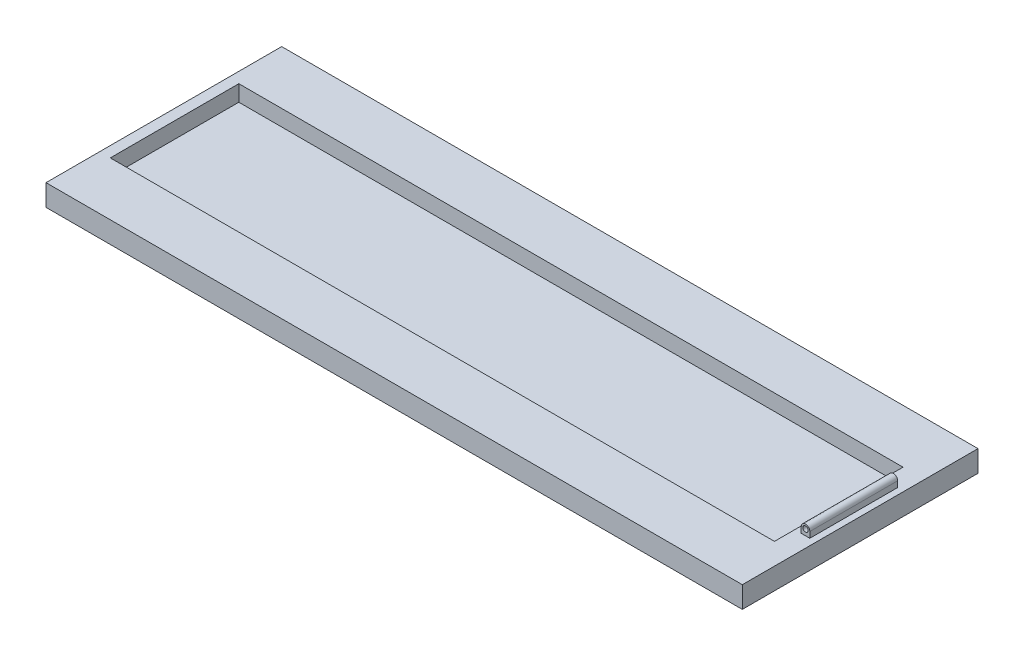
ISO-10303-21;
HEADER;
FILE_DESCRIPTION(('STEP AP214'),'2;1');
FILE_NAME('part.step','',(''),(''),'','','');
FILE_SCHEMA(('AUTOMOTIVE_DESIGN { 1 0 10303 214 1 1 1 1 }'));
ENDSEC;
DATA;
#1=APPLICATION_CONTEXT('core data for automotive mechanical design processes');
#2=APPLICATION_PROTOCOL_DEFINITION('international standard','automotive_design',2000,#1);
#3=PRODUCT_CONTEXT('',#1,'mechanical');
#4=PRODUCT('Part','Part','',(#3));
#5=PRODUCT_RELATED_PRODUCT_CATEGORY('part','',(#4));
#6=PRODUCT_DEFINITION_FORMATION('','',#4);
#7=PRODUCT_DEFINITION_CONTEXT('part definition',#1,'design');
#8=PRODUCT_DEFINITION('design','',#6,#7);
#9=PRODUCT_DEFINITION_SHAPE('','',#8);
#10=(LENGTH_UNIT() NAMED_UNIT(*) SI_UNIT(.MILLI.,.METRE.));
#11=(NAMED_UNIT(*) PLANE_ANGLE_UNIT() SI_UNIT($,.RADIAN.));
#12=(NAMED_UNIT(*) SI_UNIT($,.STERADIAN.) SOLID_ANGLE_UNIT());
#13=UNCERTAINTY_MEASURE_WITH_UNIT(LENGTH_MEASURE(1.E-05),#10,'distance_accuracy_value','');
#14=(GEOMETRIC_REPRESENTATION_CONTEXT(3) GLOBAL_UNCERTAINTY_ASSIGNED_CONTEXT((#13)) GLOBAL_UNIT_ASSIGNED_CONTEXT((#10,
#11,#12)) REPRESENTATION_CONTEXT('',''));
#15=CARTESIAN_POINT('',(0.,0.,0.));
#16=DIRECTION('',(0.,0.,1.));
#17=DIRECTION('',(1.,0.,0.));
#18=AXIS2_PLACEMENT_3D('',#15,#16,#17);
#19=CARTESIAN_POINT('',(-6400.,-55.,1100.));
#20=DIRECTION('',(0.,-1.,0.));
#21=DIRECTION('',(0.,0.,-1.));
#22=AXIS2_PLACEMENT_3D('',#19,#20,#21);
#23=PLANE('',#22);
#24=DIRECTION('',(1.,0.,0.));
#25=VECTOR('',#24,1.);
#26=CARTESIAN_POINT('',(-6300.,-55.,600.));
#27=LINE('',#26,#25);
#28=CARTESIAN_POINT('',(-6300.,-55.,600.));
#29=VERTEX_POINT('',#28);
#30=CARTESIAN_POINT('',(-99.9999999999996,-55.,600.));
#31=VERTEX_POINT('',#30);
#32=EDGE_CURVE('E151',#29,#31,#27,.T.);
#33=ORIENTED_EDGE('',*,*,#32,.F.);
#34=DIRECTION('',(0.,0.,1.));
#35=VECTOR('',#34,1.);
#36=CARTESIAN_POINT('',(-6300.,-55.,-600.));
#37=LINE('',#36,#35);
#38=CARTESIAN_POINT('',(-6300.,-55.,-600.));
#39=VERTEX_POINT('',#38);
#40=EDGE_CURVE('E48',#39,#29,#37,.T.);
#41=ORIENTED_EDGE('',*,*,#40,.F.);
#42=DIRECTION('',(-1.,0.,0.));
#43=VECTOR('',#42,1.);
#44=CARTESIAN_POINT('',(-6300.,-55.,-600.));
#45=LINE('',#44,#43);
#46=CARTESIAN_POINT('',(-99.9999999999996,-55.,-600.));
#47=VERTEX_POINT('',#46);
#48=EDGE_CURVE('E142',#47,#39,#45,.T.);
#49=ORIENTED_EDGE('',*,*,#48,.F.);
#50=DIRECTION('',(0.,0.,-1.));
#51=VECTOR('',#50,1.);
#52=CARTESIAN_POINT('',(-99.9999999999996,-55.,-600.));
#53=LINE('',#52,#51);
#54=EDGE_CURVE('E145',#31,#47,#53,.T.);
#55=ORIENTED_EDGE('',*,*,#54,.F.);
#56=EDGE_LOOP('',(#33,#41,#49,#55));
#57=FACE_BOUND('',#56,.T.);
#58=DIRECTION('',(-1.,0.,0.));
#59=VECTOR('',#58,1.);
#60=CARTESIAN_POINT('',(-6400.,-55.,-1100.));
#61=LINE('',#60,#59);
#62=CARTESIAN_POINT('',(100.,-55.,-1100.));
#63=VERTEX_POINT('',#62);
#64=CARTESIAN_POINT('',(-6400.,-55.,-1100.));
#65=VERTEX_POINT('',#64);
#66=EDGE_CURVE('E200',#63,#65,#61,.T.);
#67=ORIENTED_EDGE('',*,*,#66,.T.);
#68=DIRECTION('',(0.,0.,-1.));
#69=VECTOR('',#68,1.);
#70=CARTESIAN_POINT('',(-6400.,-55.,1100.));
#71=LINE('',#70,#69);
#72=CARTESIAN_POINT('',(-6400.,-55.,1100.));
#73=VERTEX_POINT('',#72);
#74=EDGE_CURVE('E206',#73,#65,#71,.T.);
#75=ORIENTED_EDGE('',*,*,#74,.F.);
#76=DIRECTION('',(-1.,0.,0.));
#77=VECTOR('',#76,1.);
#78=CARTESIAN_POINT('',(-6400.,-55.,1100.));
#79=LINE('',#78,#77);
#80=CARTESIAN_POINT('',(100.,-55.,1100.));
#81=VERTEX_POINT('',#80);
#82=EDGE_CURVE('E204',#81,#73,#79,.T.);
#83=ORIENTED_EDGE('',*,*,#82,.F.);
#84=DIRECTION('',(0.,0.,-1.));
#85=VECTOR('',#84,1.);
#86=CARTESIAN_POINT('',(100.,-55.,1100.));
#87=LINE('',#86,#85);
#88=EDGE_CURVE('E216',#81,#63,#87,.T.);
#89=ORIENTED_EDGE('',*,*,#88,.T.);
#90=EDGE_LOOP('',(#67,#75,#83,#89));
#91=FACE_BOUND('',#90,.T.);
#92=DIRECTION('',(0.,0.,-1.));
#93=VECTOR('',#92,1.);
#94=CARTESIAN_POINT('',(-40.,-55.,410.));
#95=LINE('',#94,#93);
#96=CARTESIAN_POINT('',(-40.,-55.,410.));
#97=VERTEX_POINT('',#96);
#98=CARTESIAN_POINT('',(-40.,-55.,-410.));
#99=VERTEX_POINT('',#98);
#100=EDGE_CURVE('E190',#97,#99,#95,.T.);
#101=ORIENTED_EDGE('',*,*,#100,.T.);
#102=DIRECTION('',(1.,0.,0.));
#103=VECTOR('',#102,1.);
#104=CARTESIAN_POINT('',(-40.,-55.,-410.));
#105=LINE('',#104,#103);
#106=CARTESIAN_POINT('',(40.,-55.,-410.));
#107=VERTEX_POINT('',#106);
#108=EDGE_CURVE('E182',#99,#107,#105,.T.);
#109=ORIENTED_EDGE('',*,*,#108,.T.);
#110=DIRECTION('',(0.,0.,-1.));
#111=VECTOR('',#110,1.);
#112=CARTESIAN_POINT('',(40.,-55.,410.));
#113=LINE('',#112,#111);
#114=CARTESIAN_POINT('',(40.,-55.,410.));
#115=VERTEX_POINT('',#114);
#116=EDGE_CURVE('E187',#115,#107,#113,.T.);
#117=ORIENTED_EDGE('',*,*,#116,.F.);
#118=DIRECTION('',(1.,0.,0.));
#119=VECTOR('',#118,1.);
#120=CARTESIAN_POINT('',(-40.,-55.,410.));
#121=LINE('',#120,#119);
#122=EDGE_CURVE('E56',#97,#115,#121,.T.);
#123=ORIENTED_EDGE('',*,*,#122,.F.);
#124=EDGE_LOOP('',(#101,#109,#117,#123));
#125=FACE_BOUND('',#124,.T.);
#126=ADVANCED_FACE('F33',(#57,#91,#125),#23,.F.);
#127=CARTESIAN_POINT('',(-6400.,-55.,1100.));
#128=DIRECTION('',(1.,0.,0.));
#129=DIRECTION('',(0.,0.,-1.));
#130=AXIS2_PLACEMENT_3D('',#127,#128,#129);
#131=PLANE('',#130);
#132=DIRECTION('',(0.,-1.,0.));
#133=VECTOR('',#132,1.);
#134=CARTESIAN_POINT('',(-6400.,-55.,-1100.));
#135=LINE('',#134,#133);
#136=CARTESIAN_POINT('',(-6400.,-255.,-1100.));
#137=VERTEX_POINT('',#136);
#138=EDGE_CURVE('E195',#65,#137,#135,.T.);
#139=ORIENTED_EDGE('',*,*,#138,.T.);
#140=DIRECTION('',(0.,0.,-1.));
#141=VECTOR('',#140,1.);
#142=CARTESIAN_POINT('',(-6400.,-255.,1100.));
#143=LINE('',#142,#141);
#144=CARTESIAN_POINT('',(-6400.,-255.,1100.));
#145=VERTEX_POINT('',#144);
#146=EDGE_CURVE('E11',#145,#137,#143,.T.);
#147=ORIENTED_EDGE('',*,*,#146,.F.);
#148=DIRECTION('',(0.,-1.,0.));
#149=VECTOR('',#148,1.);
#150=CARTESIAN_POINT('',(-6400.,-55.,1100.));
#151=LINE('',#150,#149);
#152=EDGE_CURVE('E196',#73,#145,#151,.T.);
#153=ORIENTED_EDGE('',*,*,#152,.F.);
#154=ORIENTED_EDGE('',*,*,#74,.T.);
#155=EDGE_LOOP('',(#139,#147,#153,#154));
#156=FACE_BOUND('',#155,.T.);
#157=ADVANCED_FACE('F35',(#156),#131,.F.);
#158=CARTESIAN_POINT('',(-6400.,-255.,1100.));
#159=DIRECTION('',(0.,1.,0.));
#160=DIRECTION('',(0.,0.,1.));
#161=AXIS2_PLACEMENT_3D('',#158,#159,#160);
#162=PLANE('',#161);
#163=DIRECTION('',(1.,0.,0.));
#164=VECTOR('',#163,1.);
#165=CARTESIAN_POINT('',(-6400.,-255.,-1100.));
#166=LINE('',#165,#164);
#167=CARTESIAN_POINT('',(100.,-255.,-1100.));
#168=VERTEX_POINT('',#167);
#169=EDGE_CURVE('E209',#137,#168,#166,.T.);
#170=ORIENTED_EDGE('',*,*,#169,.T.);
#171=DIRECTION('',(0.,0.,-1.));
#172=VECTOR('',#171,1.);
#173=CARTESIAN_POINT('',(100.,-255.,1100.));
#174=LINE('',#173,#172);
#175=CARTESIAN_POINT('',(100.,-255.,1100.));
#176=VERTEX_POINT('',#175);
#177=EDGE_CURVE('E41',#176,#168,#174,.T.);
#178=ORIENTED_EDGE('',*,*,#177,.F.);
#179=DIRECTION('',(1.,0.,0.));
#180=VECTOR('',#179,1.);
#181=CARTESIAN_POINT('',(-6400.,-255.,1100.));
#182=LINE('',#181,#180);
#183=EDGE_CURVE('E199',#145,#176,#182,.T.);
#184=ORIENTED_EDGE('',*,*,#183,.F.);
#185=ORIENTED_EDGE('',*,*,#146,.T.);
#186=EDGE_LOOP('',(#170,#178,#184,#185));
#187=FACE_BOUND('',#186,.T.);
#188=ADVANCED_FACE('F238',(#187),#162,.F.);
#189=CARTESIAN_POINT('',(100.,-55.,1100.));
#190=DIRECTION('',(-1.,0.,0.));
#191=DIRECTION('',(0.,-1.,0.));
#192=AXIS2_PLACEMENT_3D('',#189,#190,#191);
#193=PLANE('',#192);
#194=DIRECTION('',(0.,1.,0.));
#195=VECTOR('',#194,1.);
#196=CARTESIAN_POINT('',(100.,-55.,-1100.));
#197=LINE('',#196,#195);
#198=EDGE_CURVE('E211',#168,#63,#197,.T.);
#199=ORIENTED_EDGE('',*,*,#198,.T.);
#200=ORIENTED_EDGE('',*,*,#88,.F.);
#201=DIRECTION('',(0.,1.,0.));
#202=VECTOR('',#201,1.);
#203=CARTESIAN_POINT('',(100.,-55.,1100.));
#204=LINE('',#203,#202);
#205=EDGE_CURVE('E202',#176,#81,#204,.T.);
#206=ORIENTED_EDGE('',*,*,#205,.F.);
#207=ORIENTED_EDGE('',*,*,#177,.T.);
#208=EDGE_LOOP('',(#199,#200,#206,#207));
#209=FACE_BOUND('',#208,.T.);
#210=ADVANCED_FACE('F223',(#209),#193,.F.);
#211=CARTESIAN_POINT('',(-6400.,-255.,1100.));
#212=DIRECTION('',(0.,0.,1.));
#213=DIRECTION('',(1.,0.,0.));
#214=AXIS2_PLACEMENT_3D('',#211,#212,#213);
#215=PLANE('',#214);
#216=ORIENTED_EDGE('',*,*,#152,.T.);
#217=ORIENTED_EDGE('',*,*,#183,.T.);
#218=ORIENTED_EDGE('',*,*,#205,.T.);
#219=ORIENTED_EDGE('',*,*,#82,.T.);
#220=EDGE_LOOP('',(#216,#217,#218,#219));
#221=FACE_BOUND('',#220,.T.);
#222=ADVANCED_FACE('F237',(#221),#215,.T.);
#223=CARTESIAN_POINT('',(-6400.,-255.,-1100.));
#224=DIRECTION('',(0.,0.,1.));
#225=DIRECTION('',(1.,0.,0.));
#226=AXIS2_PLACEMENT_3D('',#223,#224,#225);
#227=PLANE('',#226);
#228=ORIENTED_EDGE('',*,*,#138,.F.);
#229=ORIENTED_EDGE('',*,*,#66,.F.);
#230=ORIENTED_EDGE('',*,*,#198,.F.);
#231=ORIENTED_EDGE('',*,*,#169,.F.);
#232=EDGE_LOOP('',(#228,#229,#230,#231));
#233=FACE_BOUND('',#232,.T.);
#234=ADVANCED_FACE('F229',(#233),#227,.F.);
#235=CARTESIAN_POINT('',(0.,0.,410.));
#236=DIRECTION('',(0.,0.,1.));
#237=DIRECTION('',(1.,0.,0.));
#238=AXIS2_PLACEMENT_3D('',#235,#236,#237);
#239=PLANE('',#238);
#240=CARTESIAN_POINT('',(0.,0.,410.));
#241=DIRECTION('',(0.,0.,1.));
#242=DIRECTION('',(1.,0.,0.));
#243=AXIS2_PLACEMENT_3D('',#240,#241,#242);
#244=CIRCLE('',#243,40.);
#245=CARTESIAN_POINT('',(40.,0.,410.));
#246=VERTEX_POINT('',#245);
#247=CARTESIAN_POINT('',(-40.,0.,410.));
#248=VERTEX_POINT('',#247);
#249=EDGE_CURVE('E167',#246,#248,#244,.T.);
#250=ORIENTED_EDGE('',*,*,#249,.T.);
#251=DIRECTION('',(0.,-1.,0.));
#252=VECTOR('',#251,1.);
#253=CARTESIAN_POINT('',(-40.,0.,410.));
#254=LINE('',#253,#252);
#255=EDGE_CURVE('E170',#248,#97,#254,.T.);
#256=ORIENTED_EDGE('',*,*,#255,.T.);
#257=ORIENTED_EDGE('',*,*,#122,.T.);
#258=DIRECTION('',(0.,1.,0.));
#259=VECTOR('',#258,1.);
#260=CARTESIAN_POINT('',(40.,-55.,410.));
#261=LINE('',#260,#259);
#262=EDGE_CURVE('E174',#115,#246,#261,.T.);
#263=ORIENTED_EDGE('',*,*,#262,.T.);
#264=EDGE_LOOP('',(#250,#256,#257,#263));
#265=FACE_BOUND('',#264,.T.);
#266=CARTESIAN_POINT('',(0.,0.,410.));
#267=DIRECTION('',(0.,0.,1.));
#268=DIRECTION('',(1.,0.,0.));
#269=AXIS2_PLACEMENT_3D('',#266,#267,#268);
#270=CIRCLE('',#269,25.);
#271=CARTESIAN_POINT('',(-25.,0.,410.));
#272=VERTEX_POINT('',#271);
#273=EDGE_CURVE('E161',#272,#272,#270,.T.);
#274=ORIENTED_EDGE('',*,*,#273,.F.);
#275=EDGE_LOOP('',(#274));
#276=FACE_BOUND('',#275,.T.);
#277=ADVANCED_FACE('F253',(#265,#276),#239,.T.);
#278=CARTESIAN_POINT('',(0.,0.,-410.));
#279=DIRECTION('',(0.,0.,1.));
#280=DIRECTION('',(1.,0.,0.));
#281=AXIS2_PLACEMENT_3D('',#278,#279,#280);
#282=PLANE('',#281);
#283=CARTESIAN_POINT('',(0.,0.,-410.));
#284=DIRECTION('',(0.,0.,1.));
#285=DIRECTION('',(1.,0.,0.));
#286=AXIS2_PLACEMENT_3D('',#283,#284,#285);
#287=CIRCLE('',#286,40.);
#288=CARTESIAN_POINT('',(40.,0.,-410.));
#289=VERTEX_POINT('',#288);
#290=CARTESIAN_POINT('',(-40.,0.,-410.));
#291=VERTEX_POINT('',#290);
#292=EDGE_CURVE('E164',#289,#291,#287,.T.);
#293=ORIENTED_EDGE('',*,*,#292,.F.);
#294=DIRECTION('',(0.,1.,0.));
#295=VECTOR('',#294,1.);
#296=CARTESIAN_POINT('',(40.,-55.,-410.));
#297=LINE('',#296,#295);
#298=EDGE_CURVE('E171',#107,#289,#297,.T.);
#299=ORIENTED_EDGE('',*,*,#298,.F.);
#300=ORIENTED_EDGE('',*,*,#108,.F.);
#301=DIRECTION('',(0.,-1.,0.));
#302=VECTOR('',#301,1.);
#303=CARTESIAN_POINT('',(-40.,0.,-410.));
#304=LINE('',#303,#302);
#305=EDGE_CURVE('E179',#291,#99,#304,.T.);
#306=ORIENTED_EDGE('',*,*,#305,.F.);
#307=EDGE_LOOP('',(#293,#299,#300,#306));
#308=FACE_BOUND('',#307,.T.);
#309=CARTESIAN_POINT('',(0.,0.,-410.));
#310=DIRECTION('',(0.,0.,1.));
#311=DIRECTION('',(1.,0.,0.));
#312=AXIS2_PLACEMENT_3D('',#309,#310,#311);
#313=CIRCLE('',#312,25.);
#314=CARTESIAN_POINT('',(-25.,0.,-410.));
#315=VERTEX_POINT('',#314);
#316=EDGE_CURVE('E157',#315,#315,#313,.T.);
#317=ORIENTED_EDGE('',*,*,#316,.T.);
#318=EDGE_LOOP('',(#317));
#319=FACE_BOUND('',#318,.T.);
#320=ADVANCED_FACE('F260',(#308,#319),#282,.F.);
#321=CARTESIAN_POINT('',(0.,0.,410.));
#322=DIRECTION('',(0.,0.,-1.));
#323=DIRECTION('',(-1.,0.,0.));
#324=AXIS2_PLACEMENT_3D('',#321,#322,#323);
#325=CYLINDRICAL_SURFACE('',#324,40.);
#326=ORIENTED_EDGE('',*,*,#292,.T.);
#327=DIRECTION('',(0.,0.,-1.));
#328=VECTOR('',#327,1.);
#329=CARTESIAN_POINT('',(-40.,0.,410.));
#330=LINE('',#329,#328);
#331=EDGE_CURVE('E192',#248,#291,#330,.T.);
#332=ORIENTED_EDGE('',*,*,#331,.F.);
#333=ORIENTED_EDGE('',*,*,#249,.F.);
#334=DIRECTION('',(0.,0.,-1.));
#335=VECTOR('',#334,1.);
#336=CARTESIAN_POINT('',(40.,0.,410.));
#337=LINE('',#336,#335);
#338=EDGE_CURVE('E176',#246,#289,#337,.T.);
#339=ORIENTED_EDGE('',*,*,#338,.T.);
#340=EDGE_LOOP('',(#326,#332,#333,#339));
#341=FACE_BOUND('',#340,.T.);
#342=ADVANCED_FACE('F256',(#341),#325,.T.);
#343=CARTESIAN_POINT('',(-40.,0.,410.));
#344=DIRECTION('',(1.,0.,0.));
#345=DIRECTION('',(0.,1.,0.));
#346=AXIS2_PLACEMENT_3D('',#343,#344,#345);
#347=PLANE('',#346);
#348=ORIENTED_EDGE('',*,*,#305,.T.);
#349=ORIENTED_EDGE('',*,*,#100,.F.);
#350=ORIENTED_EDGE('',*,*,#255,.F.);
#351=ORIENTED_EDGE('',*,*,#331,.T.);
#352=EDGE_LOOP('',(#348,#349,#350,#351));
#353=FACE_BOUND('',#352,.T.);
#354=ADVANCED_FACE('F259',(#353),#347,.F.);
#355=CARTESIAN_POINT('',(40.,-55.,410.));
#356=DIRECTION('',(-1.,0.,0.));
#357=DIRECTION('',(0.,0.,1.));
#358=AXIS2_PLACEMENT_3D('',#355,#356,#357);
#359=PLANE('',#358);
#360=ORIENTED_EDGE('',*,*,#298,.T.);
#361=ORIENTED_EDGE('',*,*,#338,.F.);
#362=ORIENTED_EDGE('',*,*,#262,.F.);
#363=ORIENTED_EDGE('',*,*,#116,.T.);
#364=EDGE_LOOP('',(#360,#361,#362,#363));
#365=FACE_BOUND('',#364,.T.);
#366=ADVANCED_FACE('F264',(#365),#359,.F.);
#367=CARTESIAN_POINT('',(0.,0.,410.));
#368=DIRECTION('',(0.,0.,-1.));
#369=DIRECTION('',(-1.,0.,0.));
#370=AXIS2_PLACEMENT_3D('',#367,#368,#369);
#371=CYLINDRICAL_SURFACE('',#370,25.);
#372=CARTESIAN_POINT('',(-25.,0.,410.));
#373=CARTESIAN_POINT('',(-25.,0.,401.458333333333));
#374=CARTESIAN_POINT('',(-25.,0.,392.916666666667));
#375=CARTESIAN_POINT('',(-25.,0.,375.833333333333));
#376=CARTESIAN_POINT('',(-25.,0.,367.291666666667));
#377=CARTESIAN_POINT('',(-25.,0.,350.208333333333));
#378=CARTESIAN_POINT('',(-25.,0.,341.666666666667));
#379=CARTESIAN_POINT('',(-25.,0.,324.583333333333));
#380=CARTESIAN_POINT('',(-25.,0.,316.041666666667));
#381=CARTESIAN_POINT('',(-25.,0.,298.958333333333));
#382=CARTESIAN_POINT('',(-25.,0.,290.416666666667));
#383=CARTESIAN_POINT('',(-25.,0.,273.333333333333));
#384=CARTESIAN_POINT('',(-25.,0.,264.791666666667));
#385=CARTESIAN_POINT('',(-25.,0.,247.708333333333));
#386=CARTESIAN_POINT('',(-25.,0.,239.166666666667));
#387=CARTESIAN_POINT('',(-25.,0.,222.083333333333));
#388=CARTESIAN_POINT('',(-25.,0.,213.541666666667));
#389=CARTESIAN_POINT('',(-25.,0.,196.458333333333));
#390=CARTESIAN_POINT('',(-25.,0.,187.916666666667));
#391=CARTESIAN_POINT('',(-25.,0.,170.833333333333));
#392=CARTESIAN_POINT('',(-25.,0.,162.291666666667));
#393=CARTESIAN_POINT('',(-25.,0.,145.208333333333));
#394=CARTESIAN_POINT('',(-25.,0.,136.666666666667));
#395=CARTESIAN_POINT('',(-25.,0.,119.583333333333));
#396=CARTESIAN_POINT('',(-25.,0.,111.041666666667));
#397=CARTESIAN_POINT('',(-25.,0.,93.9583333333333));
#398=CARTESIAN_POINT('',(-25.,0.,85.4166666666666));
#399=CARTESIAN_POINT('',(-25.,0.,68.3333333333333));
#400=CARTESIAN_POINT('',(-25.,0.,59.7916666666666));
#401=CARTESIAN_POINT('',(-25.,0.,42.7083333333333));
#402=CARTESIAN_POINT('',(-25.,0.,34.1666666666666));
#403=CARTESIAN_POINT('',(-25.,0.,17.0833333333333));
#404=CARTESIAN_POINT('',(-25.,0.,8.54166666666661));
#405=CARTESIAN_POINT('',(-25.,0.,-8.54166666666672));
#406=CARTESIAN_POINT('',(-25.,0.,-17.0833333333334));
#407=CARTESIAN_POINT('',(-25.,0.,-34.1666666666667));
#408=CARTESIAN_POINT('',(-25.,0.,-42.7083333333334));
#409=CARTESIAN_POINT('',(-25.,0.,-59.7916666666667));
#410=CARTESIAN_POINT('',(-25.,0.,-68.3333333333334));
#411=CARTESIAN_POINT('',(-25.,0.,-85.4166666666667));
#412=CARTESIAN_POINT('',(-25.,0.,-93.9583333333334));
#413=CARTESIAN_POINT('',(-25.,0.,-111.041666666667));
#414=CARTESIAN_POINT('',(-25.,0.,-119.583333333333));
#415=CARTESIAN_POINT('',(-25.,0.,-136.666666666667));
#416=CARTESIAN_POINT('',(-25.,0.,-145.208333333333));
#417=CARTESIAN_POINT('',(-25.,0.,-162.291666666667));
#418=CARTESIAN_POINT('',(-25.,0.,-170.833333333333));
#419=CARTESIAN_POINT('',(-25.,0.,-187.916666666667));
#420=CARTESIAN_POINT('',(-25.,0.,-196.458333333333));
#421=CARTESIAN_POINT('',(-25.,0.,-213.541666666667));
#422=CARTESIAN_POINT('',(-25.,0.,-222.083333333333));
#423=CARTESIAN_POINT('',(-25.,0.,-239.166666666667));
#424=CARTESIAN_POINT('',(-25.,0.,-247.708333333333));
#425=CARTESIAN_POINT('',(-25.,0.,-264.791666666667));
#426=CARTESIAN_POINT('',(-25.,0.,-273.333333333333));
#427=CARTESIAN_POINT('',(-25.,0.,-290.416666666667));
#428=CARTESIAN_POINT('',(-25.,0.,-298.958333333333));
#429=CARTESIAN_POINT('',(-25.,0.,-316.041666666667));
#430=CARTESIAN_POINT('',(-25.,0.,-324.583333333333));
#431=CARTESIAN_POINT('',(-25.,0.,-341.666666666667));
#432=CARTESIAN_POINT('',(-25.,0.,-350.208333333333));
#433=CARTESIAN_POINT('',(-25.,0.,-367.291666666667));
#434=CARTESIAN_POINT('',(-25.,0.,-375.833333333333));
#435=CARTESIAN_POINT('',(-25.,0.,-392.916666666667));
#436=CARTESIAN_POINT('',(-25.,0.,-401.458333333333));
#437=CARTESIAN_POINT('',(-25.,0.,-410.));
#438=B_SPLINE_CURVE_WITH_KNOTS('',3,(#372,#373,#374,#375,#376,#377,#378,#379,#380,#381,#382,
#383,#384,#385,#386,#387,#388,#389,#390,#391,#392,#393,#394,#395,#396,#397,#398,#399,#400,#401,
#402,#403,#404,#405,#406,#407,#408,#409,#410,#411,#412,#413,#414,#415,#416,#417,#418,#419,#420,
#421,#422,#423,#424,#425,#426,#427,#428,#429,#430,#431,#432,#433,#434,#435,#436,#437),
.UNSPECIFIED.,.F.,.F.,(4,2,2,2,2,2,2,2,2,2,2,2,2,2,2,2,2,2,2,2,2,2,2,2,2,2,2,2,2,2,2,2,4),(0.,
25.625,51.25,76.875,102.5,128.125,153.75,179.375,205.,230.625,256.25,281.875,307.5,333.125,
358.75,384.375,410.,435.625,461.25,486.875,512.5,538.125,563.75,589.375,615.,640.625,666.25,
691.875,717.5,743.125,768.75,794.375,820.),.UNSPECIFIED.);
#439=EDGE_CURVE('BSEAM268',#272,#315,#438,.T.);
#440=ORIENTED_EDGE('',*,*,#273,.T.);
#441=ORIENTED_EDGE('',*,*,#316,.F.);
#442=ORIENTED_EDGE('',*,*,#439,.T.);
#443=ORIENTED_EDGE('',*,*,#439,.F.);
#444=EDGE_LOOP('',(#440,#442,#441,#443));
#445=FACE_BOUND('',#444,.T.);
#446=ADVANCED_FACE('F268',(#445),#371,.F.);
#447=CARTESIAN_POINT('',(-6300.,-205.,-600.));
#448=DIRECTION('',(-1.,0.,0.));
#449=DIRECTION('',(0.,0.,1.));
#450=AXIS2_PLACEMENT_3D('',#447,#448,#449);
#451=PLANE('',#450);
#452=ORIENTED_EDGE('',*,*,#40,.T.);
#453=DIRECTION('',(0.,1.,0.));
#454=VECTOR('',#453,1.);
#455=CARTESIAN_POINT('',(-6300.,-205.,600.));
#456=LINE('',#455,#454);
#457=CARTESIAN_POINT('',(-6300.,-205.,600.));
#458=VERTEX_POINT('',#457);
#459=EDGE_CURVE('E120',#458,#29,#456,.T.);
#460=ORIENTED_EDGE('',*,*,#459,.F.);
#461=DIRECTION('',(0.,0.,1.));
#462=VECTOR('',#461,1.);
#463=CARTESIAN_POINT('',(-6300.,-205.,-600.));
#464=LINE('',#463,#462);
#465=CARTESIAN_POINT('',(-6300.,-205.,-600.));
#466=VERTEX_POINT('',#465);
#467=EDGE_CURVE('E124',#466,#458,#464,.T.);
#468=ORIENTED_EDGE('',*,*,#467,.F.);
#469=DIRECTION('',(0.,1.,0.));
#470=VECTOR('',#469,1.);
#471=CARTESIAN_POINT('',(-6300.,-205.,-600.));
#472=LINE('',#471,#470);
#473=EDGE_CURVE('E155',#466,#39,#472,.T.);
#474=ORIENTED_EDGE('',*,*,#473,.T.);
#475=EDGE_LOOP('',(#452,#460,#468,#474));
#476=FACE_BOUND('',#475,.T.);
#477=ADVANCED_FACE('F122',(#476),#451,.F.);
#478=CARTESIAN_POINT('',(-6300.,-205.,-600.));
#479=DIRECTION('',(0.,0.,-1.));
#480=DIRECTION('',(-1.,0.,0.));
#481=AXIS2_PLACEMENT_3D('',#478,#479,#480);
#482=PLANE('',#481);
#483=ORIENTED_EDGE('',*,*,#48,.T.);
#484=ORIENTED_EDGE('',*,*,#473,.F.);
#485=DIRECTION('',(-1.,0.,0.));
#486=VECTOR('',#485,1.);
#487=CARTESIAN_POINT('',(-6300.,-205.,-600.));
#488=LINE('',#487,#486);
#489=CARTESIAN_POINT('',(-99.9999999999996,-205.,-600.));
#490=VERTEX_POINT('',#489);
#491=EDGE_CURVE('E130',#490,#466,#488,.T.);
#492=ORIENTED_EDGE('',*,*,#491,.F.);
#493=DIRECTION('',(0.,1.,0.));
#494=VECTOR('',#493,1.);
#495=CARTESIAN_POINT('',(-99.9999999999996,-205.,-600.));
#496=LINE('',#495,#494);
#497=EDGE_CURVE('E158',#490,#47,#496,.T.);
#498=ORIENTED_EDGE('',*,*,#497,.T.);
#499=EDGE_LOOP('',(#483,#484,#492,#498));
#500=FACE_BOUND('',#499,.T.);
#501=ADVANCED_FACE('F281',(#500),#482,.F.);
#502=CARTESIAN_POINT('',(-99.9999999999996,-205.,-600.));
#503=DIRECTION('',(1.,0.,0.));
#504=DIRECTION('',(0.,0.,-1.));
#505=AXIS2_PLACEMENT_3D('',#502,#503,#504);
#506=PLANE('',#505);
#507=ORIENTED_EDGE('',*,*,#54,.T.);
#508=ORIENTED_EDGE('',*,*,#497,.F.);
#509=DIRECTION('',(0.,0.,-1.));
#510=VECTOR('',#509,1.);
#511=CARTESIAN_POINT('',(-99.9999999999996,-205.,-600.));
#512=LINE('',#511,#510);
#513=CARTESIAN_POINT('',(-99.9999999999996,-205.,600.));
#514=VERTEX_POINT('',#513);
#515=EDGE_CURVE('E138',#514,#490,#512,.T.);
#516=ORIENTED_EDGE('',*,*,#515,.F.);
#517=DIRECTION('',(0.,1.,0.));
#518=VECTOR('',#517,1.);
#519=CARTESIAN_POINT('',(-99.9999999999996,-205.,600.));
#520=LINE('',#519,#518);
#521=EDGE_CURVE('E129',#514,#31,#520,.T.);
#522=ORIENTED_EDGE('',*,*,#521,.T.);
#523=EDGE_LOOP('',(#507,#508,#516,#522));
#524=FACE_BOUND('',#523,.T.);
#525=ADVANCED_FACE('F284',(#524),#506,.F.);
#526=CARTESIAN_POINT('',(-6300.,-205.,600.));
#527=DIRECTION('',(0.,0.,1.));
#528=DIRECTION('',(1.,0.,0.));
#529=AXIS2_PLACEMENT_3D('',#526,#527,#528);
#530=PLANE('',#529);
#531=ORIENTED_EDGE('',*,*,#32,.T.);
#532=ORIENTED_EDGE('',*,*,#521,.F.);
#533=DIRECTION('',(1.,0.,0.));
#534=VECTOR('',#533,1.);
#535=CARTESIAN_POINT('',(-6300.,-205.,600.));
#536=LINE('',#535,#534);
#537=EDGE_CURVE('E133',#458,#514,#536,.T.);
#538=ORIENTED_EDGE('',*,*,#537,.F.);
#539=ORIENTED_EDGE('',*,*,#459,.T.);
#540=EDGE_LOOP('',(#531,#532,#538,#539));
#541=FACE_BOUND('',#540,.T.);
#542=ADVANCED_FACE('F134',(#541),#530,.F.);
#543=CARTESIAN_POINT('',(-6300.,-205.,600.));
#544=DIRECTION('',(0.,1.,0.));
#545=DIRECTION('',(0.,0.,1.));
#546=AXIS2_PLACEMENT_3D('',#543,#544,#545);
#547=PLANE('',#546);
#548=ORIENTED_EDGE('',*,*,#467,.T.);
#549=ORIENTED_EDGE('',*,*,#537,.T.);
#550=ORIENTED_EDGE('',*,*,#515,.T.);
#551=ORIENTED_EDGE('',*,*,#491,.T.);
#552=EDGE_LOOP('',(#548,#549,#550,#551));
#553=FACE_BOUND('',#552,.T.);
#554=ADVANCED_FACE('F140',(#553),#547,.T.);
#555=CLOSED_SHELL('',(#126,#157,#188,#210,#222,#234,#277,#320,#342,#354,#366,#446,#477,#501,
#525,#542,#554));
#556=MANIFOLD_SOLID_BREP('B2',#555);
#557=ADVANCED_BREP_SHAPE_REPRESENTATION('',(#18,#556),#14);
#558=SHAPE_DEFINITION_REPRESENTATION(#9,#557);
ENDSEC;
END-ISO-10303-21;
